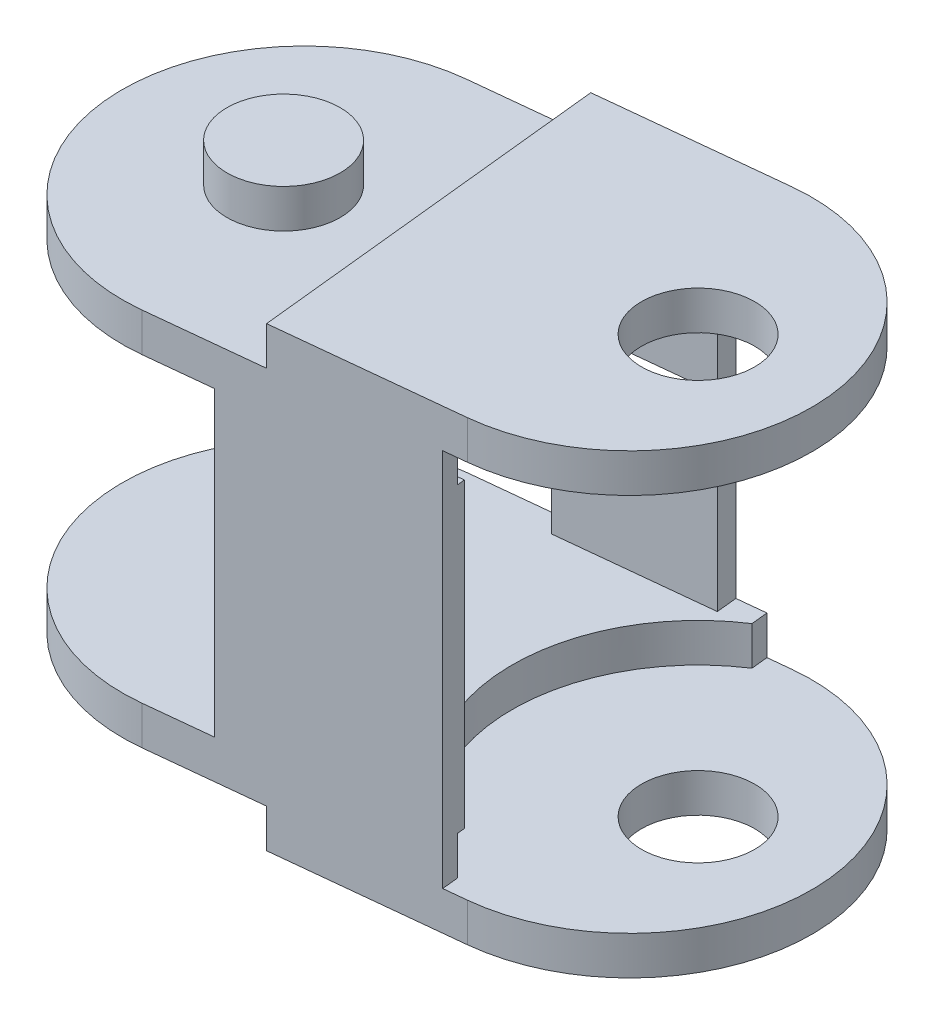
ISO-10303-21;
HEADER;
FILE_DESCRIPTION(('STEP AP214'),'2;1');
FILE_NAME('part.step','',(''),(''),'','','');
FILE_SCHEMA(('AUTOMOTIVE_DESIGN { 1 0 10303 214 1 1 1 1 }'));
ENDSEC;
DATA;
#1=APPLICATION_CONTEXT('core data for automotive mechanical design processes');
#2=APPLICATION_PROTOCOL_DEFINITION('international standard','automotive_design',2000,#1);
#3=PRODUCT_CONTEXT('',#1,'mechanical');
#4=PRODUCT('Part','Part','',(#3));
#5=PRODUCT_RELATED_PRODUCT_CATEGORY('part','',(#4));
#6=PRODUCT_DEFINITION_FORMATION('','',#4);
#7=PRODUCT_DEFINITION_CONTEXT('part definition',#1,'design');
#8=PRODUCT_DEFINITION('design','',#6,#7);
#9=PRODUCT_DEFINITION_SHAPE('','',#8);
#10=(LENGTH_UNIT() NAMED_UNIT(*) SI_UNIT(.MILLI.,.METRE.));
#11=(NAMED_UNIT(*) PLANE_ANGLE_UNIT() SI_UNIT($,.RADIAN.));
#12=(NAMED_UNIT(*) SI_UNIT($,.STERADIAN.) SOLID_ANGLE_UNIT());
#13=UNCERTAINTY_MEASURE_WITH_UNIT(LENGTH_MEASURE(1.E-05),#10,'distance_accuracy_value','');
#14=(GEOMETRIC_REPRESENTATION_CONTEXT(3) GLOBAL_UNCERTAINTY_ASSIGNED_CONTEXT((#13)) GLOBAL_UNIT_ASSIGNED_CONTEXT((#10,
#11,#12)) REPRESENTATION_CONTEXT('',''));
#15=CARTESIAN_POINT('',(0.,0.,0.));
#16=DIRECTION('',(0.,0.,1.));
#17=DIRECTION('',(1.,0.,0.));
#18=AXIS2_PLACEMENT_3D('',#15,#16,#17);
#19=CARTESIAN_POINT('',(-539.8914326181,20.1,2.0810834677));
#20=DIRECTION('',(0.,1.,0.));
#21=DIRECTION('',(0.,0.,1.));
#22=AXIS2_PLACEMENT_3D('',#19,#20,#21);
#23=PLANE('',#22);
#24=CARTESIAN_POINT('',(-539.8914326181,20.1,2.0810834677));
#25=DIRECTION('',(0.,-1.,0.));
#26=DIRECTION('',(0.,0.,-1.));
#27=AXIS2_PLACEMENT_3D('',#24,#25,#26);
#28=CIRCLE('',#27,3.00000000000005);
#29=CARTESIAN_POINT('',(-539.8914326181,20.1,-0.918916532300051));
#30=VERTEX_POINT('',#29);
#31=EDGE_CURVE('E381',#30,#30,#28,.T.);
#32=ORIENTED_EDGE('',*,*,#31,.F.);
#33=EDGE_LOOP('',(#32));
#34=FACE_BOUND('',#33,.T.);
#35=ADVANCED_FACE('F17',(#34),#23,.T.);
#36=CARTESIAN_POINT('',(-524.47557233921,8.,0.46824377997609));
#37=DIRECTION('',(0.99457163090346,0.,-0.104054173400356));
#38=DIRECTION('',(-0.104054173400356,0.,-0.99457163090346));
#39=AXIS2_PLACEMENT_3D('',#36,#37,#38);
#40=PLANE('',#39);
#41=DIRECTION('',(0.,1.,0.));
#42=VECTOR('',#41,1.);
#43=CARTESIAN_POINT('',(-525.47969511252,20.1,-9.1293724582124));
#44=LINE('',#43,#42);
#45=CARTESIAN_POINT('',(-525.479695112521,18.05,-9.12937245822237));
#46=VERTEX_POINT('',#45);
#47=CARTESIAN_POINT('',(-525.479695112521,16.,-9.1293724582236));
#48=VERTEX_POINT('',#47);
#49=EDGE_CURVE('E390',#46,#48,#44,.F.);
#50=ORIENTED_EDGE('',*,*,#49,.F.);
#51=DIRECTION('',(-0.104054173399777,0.,-0.994571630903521));
#52=VECTOR('',#51,1.);
#53=CARTESIAN_POINT('',(-525.38729415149,18.05,-8.24618467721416));
#54=LINE('',#53,#52);
#55=CARTESIAN_POINT('',(-525.38729415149,18.05,-8.24618467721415));
#56=VERTEX_POINT('',#55);
#57=EDGE_CURVE('E393',#56,#46,#54,.T.);
#58=ORIENTED_EDGE('',*,*,#57,.F.);
#59=DIRECTION('',(0.,-1.,0.));
#60=VECTOR('',#59,1.);
#61=CARTESIAN_POINT('',(-525.38729415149,17.025,-8.24618467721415));
#62=LINE('',#61,#60);
#63=CARTESIAN_POINT('',(-525.38729415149,16.,-8.2461846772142));
#64=VERTEX_POINT('',#63);
#65=EDGE_CURVE('E378',#56,#64,#62,.T.);
#66=ORIENTED_EDGE('',*,*,#65,.T.);
#67=DIRECTION('',(-0.104054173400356,0.,-0.99457163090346));
#68=VECTOR('',#67,1.);
#69=CARTESIAN_POINT('',(-524.47557233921,16.,0.46824377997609));
#70=LINE('',#69,#68);
#71=EDGE_CURVE('E236',#64,#48,#70,.T.);
#72=ORIENTED_EDGE('',*,*,#71,.T.);
#73=EDGE_LOOP('',(#50,#58,#66,#72));
#74=FACE_BOUND('',#73,.T.);
#75=ADVANCED_FACE('F798',(#74),#40,.T.);
#76=CARTESIAN_POINT('',(-534.870895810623,8.,-7.59384341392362));
#77=DIRECTION('',(0.99457163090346,0.,-0.104054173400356));
#78=DIRECTION('',(-0.104054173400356,0.,-0.99457163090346));
#79=AXIS2_PLACEMENT_3D('',#76,#77,#78);
#80=PLANE('',#79);
#81=DIRECTION('',(0.,1.,0.));
#82=VECTOR('',#81,1.);
#83=CARTESIAN_POINT('',(-534.813666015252,8.,-7.0468290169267));
#84=LINE('',#83,#82);
#85=CARTESIAN_POINT('',(-534.813666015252,10.,-7.04682901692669));
#86=VERTEX_POINT('',#85);
#87=CARTESIAN_POINT('',(-534.813666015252,16.,-7.04682901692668));
#88=VERTEX_POINT('',#87);
#89=EDGE_CURVE('E230',#86,#88,#84,.T.);
#90=ORIENTED_EDGE('',*,*,#89,.T.);
#91=DIRECTION('',(-0.104054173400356,0.,-0.99457163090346));
#92=VECTOR('',#91,1.);
#93=CARTESIAN_POINT('',(-534.870895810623,16.,-7.59384341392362));
#94=LINE('',#93,#92);
#95=CARTESIAN_POINT('',(-534.928125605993,16.,-8.14085781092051));
#96=VERTEX_POINT('',#95);
#97=EDGE_CURVE('E225',#96,#88,#94,.F.);
#98=ORIENTED_EDGE('',*,*,#97,.F.);
#99=DIRECTION('',(0.,1.,0.));
#100=VECTOR('',#99,1.);
#101=CARTESIAN_POINT('',(-534.928125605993,20.1,-8.14085781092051));
#102=LINE('',#101,#100);
#103=CARTESIAN_POINT('',(-534.928125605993,10.,-8.14085781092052));
#104=VERTEX_POINT('',#103);
#105=EDGE_CURVE('E229',#104,#96,#102,.T.);
#106=ORIENTED_EDGE('',*,*,#105,.F.);
#107=DIRECTION('',(-0.104054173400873,0.,-0.994571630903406));
#108=VECTOR('',#107,1.);
#109=CARTESIAN_POINT('',(-534.813666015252,10.,-7.04682901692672));
#110=LINE('',#109,#108);
#111=EDGE_CURVE('E407',#86,#104,#110,.T.);
#112=ORIENTED_EDGE('',*,*,#111,.F.);
#113=EDGE_LOOP('',(#90,#98,#106,#112));
#114=FACE_BOUND('',#113,.T.);
#115=ADVANCED_FACE('F227',(#114),#80,.F.);
#116=CARTESIAN_POINT('',(-526.914322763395,8.,-8.42627680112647));
#117=DIRECTION('',(-0.99457163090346,0.,0.104054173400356));
#118=DIRECTION('',(0.104054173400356,0.,0.99457163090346));
#119=AXIS2_PLACEMENT_3D('',#116,#117,#118);
#120=PLANE('',#119);
#121=DIRECTION('',(0.,1.,0.));
#122=VECTOR('',#121,1.);
#123=CARTESIAN_POINT('',(-526.971552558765,20.1,-8.97329119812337));
#124=LINE('',#123,#122);
#125=CARTESIAN_POINT('',(-526.971552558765,16.,-8.97329119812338));
#126=VERTEX_POINT('',#125);
#127=CARTESIAN_POINT('',(-526.971552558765,10.,-8.97329119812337));
#128=VERTEX_POINT('',#127);
#129=EDGE_CURVE('E424',#126,#128,#124,.F.);
#130=ORIENTED_EDGE('',*,*,#129,.F.);
#131=DIRECTION('',(0.104054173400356,0.,0.99457163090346));
#132=VECTOR('',#131,1.);
#133=CARTESIAN_POINT('',(-526.914322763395,16.,-8.42627680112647));
#134=LINE('',#133,#132);
#135=CARTESIAN_POINT('',(-526.857092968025,16.,-7.87926240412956));
#136=VERTEX_POINT('',#135);
#137=EDGE_CURVE('E235',#136,#126,#134,.F.);
#138=ORIENTED_EDGE('',*,*,#137,.F.);
#139=DIRECTION('',(0.,1.,0.));
#140=VECTOR('',#139,1.);
#141=CARTESIAN_POINT('',(-526.857092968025,8.,-7.87926240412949));
#142=LINE('',#141,#140);
#143=CARTESIAN_POINT('',(-526.857092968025,10.,-7.87926240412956));
#144=VERTEX_POINT('',#143);
#145=EDGE_CURVE('E436',#136,#144,#142,.F.);
#146=ORIENTED_EDGE('',*,*,#145,.T.);
#147=DIRECTION('',(0.104054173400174,0.,0.994571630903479));
#148=VECTOR('',#147,1.);
#149=CARTESIAN_POINT('',(-526.971552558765,10.,-8.97329119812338));
#150=LINE('',#149,#148);
#151=EDGE_CURVE('E402',#128,#144,#150,.T.);
#152=ORIENTED_EDGE('',*,*,#151,.F.);
#153=EDGE_LOOP('',(#130,#138,#146,#152));
#154=FACE_BOUND('',#153,.T.);
#155=ADVANCED_FACE('F792',(#154),#120,.F.);
#156=CARTESIAN_POINT('',(-530.892609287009,10.,-8.01006010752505));
#157=DIRECTION('',(0.,-1.,0.));
#158=DIRECTION('',(0.,0.,-1.));
#159=AXIS2_PLACEMENT_3D('',#156,#157,#158);
#160=PLANE('',#159);
#161=ORIENTED_EDGE('',*,*,#151,.T.);
#162=DIRECTION('',(-0.99457163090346,0.,0.104054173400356));
#163=VECTOR('',#162,1.);
#164=CARTESIAN_POINT('',(-530.835379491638,10.,-7.46304571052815));
#165=LINE('',#164,#163);
#166=EDGE_CURVE('E432',#144,#86,#165,.T.);
#167=ORIENTED_EDGE('',*,*,#166,.T.);
#168=ORIENTED_EDGE('',*,*,#111,.T.);
#169=DIRECTION('',(-0.99457163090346,0.,0.104054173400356));
#170=VECTOR('',#169,1.);
#171=CARTESIAN_POINT('',(-532.093596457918,10.,-8.43741220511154));
#172=LINE('',#171,#170);
#173=EDGE_CURVE('E246',#128,#104,#172,.T.);
#174=ORIENTED_EDGE('',*,*,#173,.F.);
#175=EDGE_LOOP('',(#161,#167,#168,#174));
#176=FACE_BOUND('',#175,.T.);
#177=ADVANCED_FACE('F788',(#176),#160,.T.);
#178=CARTESIAN_POINT('',(-539.8914326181,-4.1,2.0810834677));
#179=DIRECTION('',(0.,-1.,0.));
#180=DIRECTION('',(0.,0.,-1.));
#181=AXIS2_PLACEMENT_3D('',#178,#179,#180);
#182=PLANE('',#181);
#183=CARTESIAN_POINT('',(-539.8914326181,-4.1,2.0810834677));
#184=DIRECTION('',(0.,-1.,0.));
#185=DIRECTION('',(0.,0.,-1.));
#186=AXIS2_PLACEMENT_3D('',#183,#184,#185);
#187=CIRCLE('',#186,3.00000000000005);
#188=CARTESIAN_POINT('',(-539.8914326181,-4.1,-0.918916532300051));
#189=VERTEX_POINT('',#188);
#190=EDGE_CURVE('E435',#189,#189,#187,.F.);
#191=ORIENTED_EDGE('',*,*,#190,.F.);
#192=EDGE_LOOP('',(#191));
#193=FACE_BOUND('',#192,.T.);
#194=ADVANCED_FACE('F785',(#193),#182,.T.);
#195=CARTESIAN_POINT('',(-514.529856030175,18.05,-0.572297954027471));
#196=DIRECTION('',(0.,-1.,0.));
#197=DIRECTION('',(0.,0.,-1.));
#198=AXIS2_PLACEMENT_3D('',#195,#196,#197);
#199=PLANE('',#198);
#200=CARTESIAN_POINT('',(-520.000000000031,18.05,-3.07121883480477E-10));
#201=DIRECTION('',(0.,-1.,0.));
#202=DIRECTION('',(0.,0.,-1.));
#203=AXIS2_PLACEMENT_3D('',#200,#201,#202);
#204=CIRCLE('',#203,3.00000000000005);
#205=CARTESIAN_POINT('',(-520.000000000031,18.05,-3.00000000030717));
#206=VERTEX_POINT('',#205);
#207=EDGE_CURVE('E20',#206,#206,#204,.F.);
#208=ORIENTED_EDGE('',*,*,#207,.T.);
#209=EDGE_LOOP('',(#208));
#210=FACE_BOUND('',#209,.T.);
#211=ORIENTED_EDGE('',*,*,#57,.T.);
#212=DIRECTION('',(-0.99457163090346,0.,0.104054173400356));
#213=VECTOR('',#212,1.);
#214=CARTESIAN_POINT('',(-532.093596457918,18.05,-8.43741220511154));
#215=LINE('',#214,#213);
#216=CARTESIAN_POINT('',(-524.286209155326,18.05,-9.25423746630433));
#217=VERTEX_POINT('',#216);
#218=EDGE_CURVE('E247',#217,#46,#215,.T.);
#219=ORIENTED_EDGE('',*,*,#218,.F.);
#220=CARTESIAN_POINT('',(-523.282086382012,18.05,0.343378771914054));
#221=DIRECTION('',(0.,-1.,0.));
#222=DIRECTION('',(0.,0.,-1.));
#223=AXIS2_PLACEMENT_3D('',#220,#221,#222);
#224=CIRCLE('',#223,9.65);
#225=CARTESIAN_POINT('',(-522.277963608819,18.05,9.94099501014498));
#226=VERTEX_POINT('',#225);
#227=EDGE_CURVE('E387',#226,#217,#224,.F.);
#228=ORIENTED_EDGE('',*,*,#227,.F.);
#229=DIRECTION('',(-0.994571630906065,0.,0.104054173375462));
#230=VECTOR('',#229,1.);
#231=CARTESIAN_POINT('',(-522.277963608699,18.05,9.94099501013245));
#232=LINE('',#231,#230);
#233=CARTESIAN_POINT('',(-523.471449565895,18.05,10.0658600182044));
#234=VERTEX_POINT('',#233);
#235=EDGE_CURVE('E398',#226,#234,#232,.T.);
#236=ORIENTED_EDGE('',*,*,#235,.T.);
#237=DIRECTION('',(-0.104054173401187,0.,-0.994571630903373));
#238=VECTOR('',#237,1.);
#239=CARTESIAN_POINT('',(-523.471449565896,18.05,10.0658600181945));
#240=LINE('',#239,#238);
#241=CARTESIAN_POINT('',(-523.563850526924,18.05,9.18267223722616));
#242=VERTEX_POINT('',#241);
#243=EDGE_CURVE('E139',#234,#242,#240,.T.);
#244=ORIENTED_EDGE('',*,*,#243,.T.);
#245=CARTESIAN_POINT('',(-520.000000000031,18.05,-3.07121883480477E-10));
#246=DIRECTION('',(0.,-1.,0.));
#247=DIRECTION('',(0.,0.,-1.));
#248=AXIS2_PLACEMENT_3D('',#245,#246,#247);
#249=CIRCLE('',#248,9.85000000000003);
#250=EDGE_CURVE('E498',#242,#56,#249,.T.);
#251=ORIENTED_EDGE('',*,*,#250,.T.);
#252=EDGE_LOOP('',(#211,#219,#228,#236,#244,#251));
#253=FACE_BOUND('',#252,.T.);
#254=ADVANCED_FACE('F507',(#210,#253),#199,.T.);
#255=CARTESIAN_POINT('',(-520.000000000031,19.075,-3.07121883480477E-10));
#256=DIRECTION('',(0.,-1.,0.));
#257=DIRECTION('',(0.,0.,-1.));
#258=AXIS2_PLACEMENT_3D('',#255,#256,#257);
#259=CYLINDRICAL_SURFACE('',#258,3.00000000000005);
#260=ORIENTED_EDGE('',*,*,#207,.F.);
#261=EDGE_LOOP('',(#260));
#262=FACE_BOUND('',#261,.T.);
#263=CARTESIAN_POINT('',(-520.000000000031,20.1,-3.07121883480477E-10));
#264=DIRECTION('',(0.,-1.,0.));
#265=DIRECTION('',(0.,0.,-1.));
#266=AXIS2_PLACEMENT_3D('',#263,#264,#265);
#267=CIRCLE('',#266,3.00000000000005);
#268=CARTESIAN_POINT('',(-520.000000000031,20.1,-3.00000000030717));
#269=VERTEX_POINT('',#268);
#270=EDGE_CURVE('E383',#269,#269,#267,.F.);
#271=ORIENTED_EDGE('',*,*,#270,.T.);
#272=EDGE_LOOP('',(#271));
#273=FACE_BOUND('',#272,.T.);
#274=ADVANCED_FACE('F509',(#262,#273),#259,.F.);
#275=CARTESIAN_POINT('',(-539.8914326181,19.075,2.0810834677));
#276=DIRECTION('',(0.,-1.,0.));
#277=DIRECTION('',(0.,0.,-1.));
#278=AXIS2_PLACEMENT_3D('',#275,#276,#277);
#279=CYLINDRICAL_SURFACE('',#278,3.00000000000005);
#280=ORIENTED_EDGE('',*,*,#31,.T.);
#281=EDGE_LOOP('',(#280));
#282=FACE_BOUND('',#281,.T.);
#283=CARTESIAN_POINT('',(-539.8914326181,18.05,2.0810834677));
#284=DIRECTION('',(0.,-1.,0.));
#285=DIRECTION('',(0.,0.,-1.));
#286=AXIS2_PLACEMENT_3D('',#283,#284,#285);
#287=CIRCLE('',#286,3.00000000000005);
#288=CARTESIAN_POINT('',(-539.8914326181,18.05,-0.918916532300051));
#289=VERTEX_POINT('',#288);
#290=EDGE_CURVE('E284',#289,#289,#287,.F.);
#291=ORIENTED_EDGE('',*,*,#290,.T.);
#292=EDGE_LOOP('',(#291));
#293=FACE_BOUND('',#292,.T.);
#294=ADVANCED_FACE('F512',(#282,#293),#279,.T.);
#295=CARTESIAN_POINT('',(-532.093596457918,20.1,-8.43741220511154));
#296=DIRECTION('',(-0.104054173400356,0.,-0.99457163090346));
#297=DIRECTION('',(-0.99457163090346,0.,0.104054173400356));
#298=AXIS2_PLACEMENT_3D('',#295,#296,#297);
#299=PLANE('',#298);
#300=DIRECTION('',(-0.99457163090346,0.,0.104054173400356));
#301=VECTOR('',#300,1.);
#302=CARTESIAN_POINT('',(-532.093596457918,16.,-8.43741220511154));
#303=LINE('',#302,#301);
#304=EDGE_CURVE('E410',#48,#126,#303,.T.);
#305=ORIENTED_EDGE('',*,*,#304,.T.);
#306=ORIENTED_EDGE('',*,*,#129,.T.);
#307=ORIENTED_EDGE('',*,*,#173,.T.);
#308=ORIENTED_EDGE('',*,*,#105,.T.);
#309=DIRECTION('',(0.994571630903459,0.,-0.104054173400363));
#310=VECTOR('',#309,1.);
#311=CARTESIAN_POINT('',(-539.90098376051,16.,-7.62058694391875));
#312=LINE('',#311,#310);
#313=CARTESIAN_POINT('',(-539.90098376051,16.,-7.62058694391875));
#314=VERTEX_POINT('',#313);
#315=EDGE_CURVE('E243',#314,#96,#312,.T.);
#316=ORIENTED_EDGE('',*,*,#315,.F.);
#317=DIRECTION('',(0.,-1.,0.));
#318=VECTOR('',#317,1.);
#319=CARTESIAN_POINT('',(-539.90098376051,20.1,-7.62058694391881));
#320=LINE('',#319,#318);
#321=CARTESIAN_POINT('',(-539.900983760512,18.05,-7.6205869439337));
#322=VERTEX_POINT('',#321);
#323=EDGE_CURVE('E375',#322,#314,#320,.T.);
#324=ORIENTED_EDGE('',*,*,#323,.F.);
#325=DIRECTION('',(0.994571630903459,0.,-0.104054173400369));
#326=VECTOR('',#325,1.);
#327=CARTESIAN_POINT('',(-539.900983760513,18.05,-7.62058694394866));
#328=LINE('',#327,#326);
#329=CARTESIAN_POINT('',(-533.933553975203,18.05,-8.2449119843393));
#330=VERTEX_POINT('',#329);
#331=EDGE_CURVE('E275',#322,#330,#328,.T.);
#332=ORIENTED_EDGE('',*,*,#331,.T.);
#333=DIRECTION('',(0.,1.,0.));
#334=VECTOR('',#333,1.);
#335=CARTESIAN_POINT('',(-533.933553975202,19.075,-8.24491198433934));
#336=LINE('',#335,#334);
#337=CARTESIAN_POINT('',(-533.933553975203,20.1,-8.24491198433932));
#338=VERTEX_POINT('',#337);
#339=EDGE_CURVE('E293',#338,#330,#336,.F.);
#340=ORIENTED_EDGE('',*,*,#339,.F.);
#341=DIRECTION('',(0.994571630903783,0.,-0.104054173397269));
#342=VECTOR('',#341,1.);
#343=CARTESIAN_POINT('',(-533.933553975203,20.1,-8.24491198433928));
#344=LINE('',#343,#342);
#345=CARTESIAN_POINT('',(-524.286209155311,20.1,-9.2542374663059));
#346=VERTEX_POINT('',#345);
#347=EDGE_CURVE('E300',#338,#346,#344,.T.);
#348=ORIENTED_EDGE('',*,*,#347,.T.);
#349=DIRECTION('',(0.,-1.,0.));
#350=VECTOR('',#349,1.);
#351=CARTESIAN_POINT('',(-524.286209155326,20.1,-9.25423746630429));
#352=LINE('',#351,#350);
#353=EDGE_CURVE('E304',#217,#346,#352,.F.);
#354=ORIENTED_EDGE('',*,*,#353,.F.);
#355=ORIENTED_EDGE('',*,*,#218,.T.);
#356=ORIENTED_EDGE('',*,*,#49,.T.);
#357=EDGE_LOOP('',(#305,#306,#307,#308,#316,#324,#332,#340,#348,#354,#355,#356));
#358=FACE_BOUND('',#357,.T.);
#359=ADVANCED_FACE('F241',(#358),#299,.T.);
#360=CARTESIAN_POINT('',(-530.835379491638,8.,-7.46304571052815));
#361=DIRECTION('',(-0.104054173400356,0.,-0.99457163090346));
#362=DIRECTION('',(-0.99457163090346,0.,0.104054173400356));
#363=AXIS2_PLACEMENT_3D('',#360,#361,#362);
#364=PLANE('',#363);
#365=ORIENTED_EDGE('',*,*,#145,.F.);
#366=DIRECTION('',(0.994571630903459,0.,-0.104054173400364));
#367=VECTOR('',#366,1.);
#368=CARTESIAN_POINT('',(-534.813666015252,16.,-7.04682901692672));
#369=LINE('',#368,#367);
#370=EDGE_CURVE('E255',#88,#136,#369,.T.);
#371=ORIENTED_EDGE('',*,*,#370,.F.);
#372=ORIENTED_EDGE('',*,*,#89,.F.);
#373=ORIENTED_EDGE('',*,*,#166,.F.);
#374=EDGE_LOOP('',(#365,#371,#372,#373));
#375=FACE_BOUND('',#374,.T.);
#376=ADVANCED_FACE('F770',(#375),#364,.F.);
#377=CARTESIAN_POINT('',(-539.8914326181,-3.075,2.0810834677));
#378=DIRECTION('',(0.,-1.,0.));
#379=DIRECTION('',(0.,0.,-1.));
#380=AXIS2_PLACEMENT_3D('',#377,#378,#379);
#381=CYLINDRICAL_SURFACE('',#380,3.00000000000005);
#382=CARTESIAN_POINT('',(-539.8914326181,-2.05,2.0810834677));
#383=DIRECTION('',(0.,-1.,0.));
#384=DIRECTION('',(0.,0.,-1.));
#385=AXIS2_PLACEMENT_3D('',#382,#383,#384);
#386=CIRCLE('',#385,3.00000000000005);
#387=CARTESIAN_POINT('',(-539.8914326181,-2.05,-0.918916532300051));
#388=VERTEX_POINT('',#387);
#389=EDGE_CURVE('E473',#388,#388,#386,.F.);
#390=ORIENTED_EDGE('',*,*,#389,.F.);
#391=EDGE_LOOP('',(#390));
#392=FACE_BOUND('',#391,.T.);
#393=ORIENTED_EDGE('',*,*,#190,.T.);
#394=EDGE_LOOP('',(#393));
#395=FACE_BOUND('',#394,.T.);
#396=ADVANCED_FACE('F760',(#392,#395),#381,.T.);
#397=CARTESIAN_POINT('',(-520.000000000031,-3.075,-3.07121883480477E-10));
#398=DIRECTION('',(0.,-1.,0.));
#399=DIRECTION('',(0.,0.,-1.));
#400=AXIS2_PLACEMENT_3D('',#397,#398,#399);
#401=CYLINDRICAL_SURFACE('',#400,3.00000000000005);
#402=CARTESIAN_POINT('',(-520.000000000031,-4.1,-3.07121883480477E-10));
#403=DIRECTION('',(0.,-1.,0.));
#404=DIRECTION('',(0.,0.,-1.));
#405=AXIS2_PLACEMENT_3D('',#402,#403,#404);
#406=CIRCLE('',#405,3.00000000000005);
#407=CARTESIAN_POINT('',(-520.000000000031,-4.1,-3.00000000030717));
#408=VERTEX_POINT('',#407);
#409=EDGE_CURVE('E478',#408,#408,#406,.F.);
#410=ORIENTED_EDGE('',*,*,#409,.F.);
#411=EDGE_LOOP('',(#410));
#412=FACE_BOUND('',#411,.T.);
#413=CARTESIAN_POINT('',(-520.000000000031,-2.05,-3.07121883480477E-10));
#414=DIRECTION('',(0.,-1.,0.));
#415=DIRECTION('',(0.,0.,-1.));
#416=AXIS2_PLACEMENT_3D('',#413,#414,#415);
#417=CIRCLE('',#416,3.00000000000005);
#418=CARTESIAN_POINT('',(-520.000000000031,-2.05,-3.00000000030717));
#419=VERTEX_POINT('',#418);
#420=EDGE_CURVE('E345',#419,#419,#417,.F.);
#421=ORIENTED_EDGE('',*,*,#420,.T.);
#422=EDGE_LOOP('',(#421));
#423=FACE_BOUND('',#422,.T.);
#424=ADVANCED_FACE('F757',(#412,#423),#401,.F.);
#425=CARTESIAN_POINT('',(-520.000000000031,17.025,-3.07121883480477E-10));
#426=DIRECTION('',(0.,-1.,0.));
#427=DIRECTION('',(0.,0.,-1.));
#428=AXIS2_PLACEMENT_3D('',#425,#426,#427);
#429=CYLINDRICAL_SURFACE('',#428,9.85000000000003);
#430=ORIENTED_EDGE('',*,*,#250,.F.);
#431=DIRECTION('',(0.,1.,0.));
#432=VECTOR('',#431,1.);
#433=CARTESIAN_POINT('',(-523.563850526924,8.,9.18267223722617));
#434=LINE('',#433,#432);
#435=CARTESIAN_POINT('',(-523.563850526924,16.,9.18267223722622));
#436=VERTEX_POINT('',#435);
#437=EDGE_CURVE('E344',#436,#242,#434,.T.);
#438=ORIENTED_EDGE('',*,*,#437,.F.);
#439=CARTESIAN_POINT('',(-520.000000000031,16.,-3.07121883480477E-10));
#440=DIRECTION('',(0.,-1.,0.));
#441=DIRECTION('',(0.,0.,-1.));
#442=AXIS2_PLACEMENT_3D('',#439,#440,#441);
#443=CIRCLE('',#442,9.85000000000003);
#444=CARTESIAN_POINT('',(-524.3117762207,16.,8.85613266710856));
#445=VERTEX_POINT('',#444);
#446=EDGE_CURVE('E495',#436,#445,#443,.T.);
#447=ORIENTED_EDGE('',*,*,#446,.T.);
#448=CARTESIAN_POINT('',(-520.000000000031,16.,-3.07121883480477E-10));
#449=DIRECTION('',(0.,-1.,0.));
#450=DIRECTION('',(0.,0.,-1.));
#451=AXIS2_PLACEMENT_3D('',#448,#449,#450);
#452=CIRCLE('',#451,9.85000000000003);
#453=EDGE_CURVE('E259',#64,#445,#452,.F.);
#454=ORIENTED_EDGE('',*,*,#453,.F.);
#455=ORIENTED_EDGE('',*,*,#65,.F.);
#456=EDGE_LOOP('',(#430,#438,#447,#454,#455));
#457=FACE_BOUND('',#456,.T.);
#458=ADVANCED_FACE('F759',(#457),#429,.F.);
#459=CARTESIAN_POINT('',(-520.000000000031,16.,-3.07121883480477E-10));
#460=DIRECTION('',(0.,-1.,0.));
#461=DIRECTION('',(0.,0.,-1.));
#462=AXIS2_PLACEMENT_3D('',#459,#460,#461);
#463=PLANE('',#462);
#464=ORIENTED_EDGE('',*,*,#446,.F.);
#465=DIRECTION('',(-0.104054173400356,0.,-0.99457163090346));
#466=VECTOR('',#465,1.);
#467=CARTESIAN_POINT('',(-524.47557233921,16.,0.46824377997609));
#468=LINE('',#467,#466);
#469=CARTESIAN_POINT('',(-523.60574188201,16.,8.78226587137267));
#470=VERTEX_POINT('',#469);
#471=EDGE_CURVE('E341',#470,#436,#468,.F.);
#472=ORIENTED_EDGE('',*,*,#471,.F.);
#473=DIRECTION('',(0.99457163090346,0.,-0.104054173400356));
#474=VECTOR('',#473,1.);
#475=CARTESIAN_POINT('',(-529.075885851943,16.,9.35456382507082));
#476=LINE('',#475,#474);
#477=EDGE_CURVE('E329',#470,#445,#476,.F.);
#478=ORIENTED_EDGE('',*,*,#477,.T.);
#479=EDGE_LOOP('',(#464,#472,#478));
#480=FACE_BOUND('',#479,.T.);
#481=ADVANCED_FACE('F767',(#480),#463,.F.);
#482=CARTESIAN_POINT('',(-523.282086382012,20.1,0.343378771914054));
#483=DIRECTION('',(0.,-1.,0.));
#484=DIRECTION('',(0.,0.,-1.));
#485=AXIS2_PLACEMENT_3D('',#482,#483,#484);
#486=CYLINDRICAL_SURFACE('',#485,9.65);
#487=CARTESIAN_POINT('',(-523.282086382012,20.1,0.343378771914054));
#488=DIRECTION('',(0.,-1.,0.));
#489=DIRECTION('',(0.,0.,-1.));
#490=AXIS2_PLACEMENT_3D('',#487,#488,#489);
#491=CIRCLE('',#490,9.65);
#492=CARTESIAN_POINT('',(-522.277963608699,20.1,9.94099501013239));
#493=VERTEX_POINT('',#492);
#494=EDGE_CURVE('E303',#346,#493,#491,.T.);
#495=ORIENTED_EDGE('',*,*,#494,.T.);
#496=DIRECTION('',(0.,1.,0.));
#497=VECTOR('',#496,1.);
#498=CARTESIAN_POINT('',(-522.277963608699,20.1,9.94099501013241));
#499=LINE('',#498,#497);
#500=EDGE_CURVE('E297',#226,#493,#499,.T.);
#501=ORIENTED_EDGE('',*,*,#500,.F.);
#502=ORIENTED_EDGE('',*,*,#227,.T.);
#503=ORIENTED_EDGE('',*,*,#353,.T.);
#504=EDGE_LOOP('',(#495,#501,#502,#503));
#505=FACE_BOUND('',#504,.T.);
#506=ADVANCED_FACE('F520',(#505),#486,.T.);
#507=CARTESIAN_POINT('',(-531.089473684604,20.1,1.16020403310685));
#508=DIRECTION('',(0.,-1.,0.));
#509=DIRECTION('',(0.,0.,-1.));
#510=AXIS2_PLACEMENT_3D('',#507,#508,#509);
#511=PLANE('',#510);
#512=ORIENTED_EDGE('',*,*,#270,.F.);
#513=EDGE_LOOP('',(#512));
#514=FACE_BOUND('',#513,.T.);
#515=DIRECTION('',(0.99457163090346,0.,-0.104054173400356));
#516=VECTOR('',#515,1.);
#517=CARTESIAN_POINT('',(-530.085350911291,20.1,10.7578202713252));
#518=LINE('',#517,#516);
#519=CARTESIAN_POINT('',(-531.925308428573,20.1,10.9503204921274));
#520=VERTEX_POINT('',#519);
#521=EDGE_CURVE('E288',#493,#520,#518,.F.);
#522=ORIENTED_EDGE('',*,*,#521,.F.);
#523=ORIENTED_EDGE('',*,*,#494,.F.);
#524=ORIENTED_EDGE('',*,*,#347,.F.);
#525=DIRECTION('',(0.104054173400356,0.,0.99457163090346));
#526=VECTOR('',#525,1.);
#527=CARTESIAN_POINT('',(-532.929431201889,20.1,1.35270425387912));
#528=LINE('',#527,#526);
#529=EDGE_CURVE('E279',#520,#338,#528,.F.);
#530=ORIENTED_EDGE('',*,*,#529,.F.);
#531=EDGE_LOOP('',(#522,#523,#524,#530));
#532=FACE_BOUND('',#531,.T.);
#533=ADVANCED_FACE('F516',(#514,#532),#511,.F.);
#534=CARTESIAN_POINT('',(-532.929431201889,19.075,1.35270425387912));
#535=DIRECTION('',(-0.99457163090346,0.,0.104054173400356));
#536=DIRECTION('',(0.104054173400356,0.,0.99457163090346));
#537=AXIS2_PLACEMENT_3D('',#534,#535,#536);
#538=PLANE('',#537);
#539=DIRECTION('',(0.,1.,0.));
#540=VECTOR('',#539,1.);
#541=CARTESIAN_POINT('',(-531.925308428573,20.1,10.9503204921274));
#542=LINE('',#541,#540);
#543=CARTESIAN_POINT('',(-531.925308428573,18.05,10.9503204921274));
#544=VERTEX_POINT('',#543);
#545=EDGE_CURVE('E272',#520,#544,#542,.F.);
#546=ORIENTED_EDGE('',*,*,#545,.F.);
#547=ORIENTED_EDGE('',*,*,#529,.T.);
#548=ORIENTED_EDGE('',*,*,#339,.T.);
#549=DIRECTION('',(0.104054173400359,0.,0.99457163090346));
#550=VECTOR('',#549,1.);
#551=CARTESIAN_POINT('',(-533.933553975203,18.05,-8.24491198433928));
#552=LINE('',#551,#550);
#553=EDGE_CURVE('E278',#330,#544,#552,.T.);
#554=ORIENTED_EDGE('',*,*,#553,.T.);
#555=EDGE_LOOP('',(#546,#547,#548,#554));
#556=FACE_BOUND('',#555,.T.);
#557=ADVANCED_FACE('F519',(#556),#538,.T.);
#558=CARTESIAN_POINT('',(-541.20924002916,18.05,2.21895524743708));
#559=DIRECTION('',(0.,-1.,0.));
#560=DIRECTION('',(0.,0.,-1.));
#561=AXIS2_PLACEMENT_3D('',#558,#559,#560);
#562=PLANE('',#561);
#563=ORIENTED_EDGE('',*,*,#290,.F.);
#564=EDGE_LOOP('',(#563));
#565=FACE_BOUND('',#564,.T.);
#566=DIRECTION('',(0.99457163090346,0.,-0.104054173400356));
#567=VECTOR('',#566,1.);
#568=CARTESIAN_POINT('',(-530.085350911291,18.05,10.7578202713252));
#569=LINE('',#568,#567);
#570=CARTESIAN_POINT('',(-537.892738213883,18.05,11.574645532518));
#571=VERTEX_POINT('',#570);
#572=EDGE_CURVE('E270',#544,#571,#569,.F.);
#573=ORIENTED_EDGE('',*,*,#572,.F.);
#574=ORIENTED_EDGE('',*,*,#553,.F.);
#575=ORIENTED_EDGE('',*,*,#331,.F.);
#576=CARTESIAN_POINT('',(-538.896860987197,18.05,1.97702929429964));
#577=DIRECTION('',(0.,-1.,0.));
#578=DIRECTION('',(0.,0.,-1.));
#579=AXIS2_PLACEMENT_3D('',#576,#577,#578);
#580=CIRCLE('',#579,9.65);
#581=EDGE_CURVE('E377',#571,#322,#580,.T.);
#582=ORIENTED_EDGE('',*,*,#581,.F.);
#583=EDGE_LOOP('',(#573,#574,#575,#582));
#584=FACE_BOUND('',#583,.T.);
#585=ADVANCED_FACE('F541',(#565,#584),#562,.F.);
#586=CARTESIAN_POINT('',(-538.896860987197,20.1,1.97702929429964));
#587=DIRECTION('',(0.,-1.,0.));
#588=DIRECTION('',(0.,0.,-1.));
#589=AXIS2_PLACEMENT_3D('',#586,#587,#588);
#590=CYLINDRICAL_SURFACE('',#589,9.65);
#591=CARTESIAN_POINT('',(-538.896860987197,16.,1.97702929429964));
#592=DIRECTION('',(0.,-1.,0.));
#593=DIRECTION('',(0.,0.,-1.));
#594=AXIS2_PLACEMENT_3D('',#591,#592,#593);
#595=CIRCLE('',#594,9.65);
#596=CARTESIAN_POINT('',(-537.892738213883,16.,11.574645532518));
#597=VERTEX_POINT('',#596);
#598=EDGE_CURVE('E254',#597,#314,#595,.T.);
#599=ORIENTED_EDGE('',*,*,#598,.F.);
#600=DIRECTION('',(0.,1.,0.));
#601=VECTOR('',#600,1.);
#602=CARTESIAN_POINT('',(-537.892738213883,20.1,11.574645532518));
#603=LINE('',#602,#601);
#604=EDGE_CURVE('E267',#571,#597,#603,.F.);
#605=ORIENTED_EDGE('',*,*,#604,.F.);
#606=ORIENTED_EDGE('',*,*,#581,.T.);
#607=ORIENTED_EDGE('',*,*,#323,.T.);
#608=EDGE_LOOP('',(#599,#605,#606,#607));
#609=FACE_BOUND('',#608,.T.);
#610=ADVANCED_FACE('F546',(#609),#590,.T.);
#611=CARTESIAN_POINT('',(-529.945716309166,16.,1.04054173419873));
#612=DIRECTION('',(0.,-1.,0.));
#613=DIRECTION('',(0.,0.,-1.));
#614=AXIS2_PLACEMENT_3D('',#611,#612,#613);
#615=PLANE('',#614);
#616=ORIENTED_EDGE('',*,*,#304,.F.);
#617=ORIENTED_EDGE('',*,*,#71,.F.);
#618=ORIENTED_EDGE('',*,*,#453,.T.);
#619=DIRECTION('',(0.99457163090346,0.,-0.104054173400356));
#620=VECTOR('',#619,1.);
#621=CARTESIAN_POINT('',(-529.075885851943,16.,9.35456382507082));
#622=LINE('',#621,#620);
#623=CARTESIAN_POINT('',(-534.546029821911,16.,9.92686177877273));
#624=VERTEX_POINT('',#623);
#625=EDGE_CURVE('E325',#445,#624,#622,.F.);
#626=ORIENTED_EDGE('',*,*,#625,.T.);
#627=DIRECTION('',(-0.104054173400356,0.,-0.99457163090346));
#628=VECTOR('',#627,1.);
#629=CARTESIAN_POINT('',(-534.478883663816,16.,10.5686588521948));
#630=LINE('',#629,#628);
#631=CARTESIAN_POINT('',(-534.411737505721,16.,11.2104559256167));
#632=VERTEX_POINT('',#631);
#633=EDGE_CURVE('E483',#624,#632,#630,.F.);
#634=ORIENTED_EDGE('',*,*,#633,.T.);
#635=DIRECTION('',(0.99457163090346,0.,-0.104054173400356));
#636=VECTOR('',#635,1.);
#637=CARTESIAN_POINT('',(-530.085350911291,16.,10.7578202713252));
#638=LINE('',#637,#636);
#639=EDGE_CURVE('E269',#597,#632,#638,.T.);
#640=ORIENTED_EDGE('',*,*,#639,.F.);
#641=ORIENTED_EDGE('',*,*,#598,.T.);
#642=ORIENTED_EDGE('',*,*,#315,.T.);
#643=ORIENTED_EDGE('',*,*,#97,.T.);
#644=ORIENTED_EDGE('',*,*,#370,.T.);
#645=ORIENTED_EDGE('',*,*,#137,.T.);
#646=EDGE_LOOP('',(#616,#617,#618,#626,#634,#640,#641,#642,#643,#644,#645));
#647=FACE_BOUND('',#646,.T.);
#648=ADVANCED_FACE('F251',(#647),#615,.T.);
#649=CARTESIAN_POINT('',(-534.478883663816,8.,10.5686588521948));
#650=DIRECTION('',(0.99457163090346,0.,-0.104054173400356));
#651=DIRECTION('',(-0.104054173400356,0.,-0.99457163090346));
#652=AXIS2_PLACEMENT_3D('',#649,#650,#651);
#653=PLANE('',#652);
#654=ORIENTED_EDGE('',*,*,#633,.F.);
#655=DIRECTION('',(0.,1.,0.));
#656=VECTOR('',#655,1.);
#657=CARTESIAN_POINT('',(-534.546029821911,8.,9.92686177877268));
#658=LINE('',#657,#656);
#659=CARTESIAN_POINT('',(-534.546029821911,0.,9.92686177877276));
#660=VERTEX_POINT('',#659);
#661=EDGE_CURVE('E328',#624,#660,#658,.F.);
#662=ORIENTED_EDGE('',*,*,#661,.T.);
#663=DIRECTION('',(-0.104054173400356,0.,-0.99457163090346));
#664=VECTOR('',#663,1.);
#665=CARTESIAN_POINT('',(-534.478883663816,0.,10.5686588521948));
#666=LINE('',#665,#664);
#667=CARTESIAN_POINT('',(-534.411737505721,0.,11.2104559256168));
#668=VERTEX_POINT('',#667);
#669=EDGE_CURVE('E257',#668,#660,#666,.T.);
#670=ORIENTED_EDGE('',*,*,#669,.F.);
#671=DIRECTION('',(0.,1.,0.));
#672=VECTOR('',#671,1.);
#673=CARTESIAN_POINT('',(-534.411737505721,20.1,11.2104559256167));
#674=LINE('',#673,#672);
#675=EDGE_CURVE('E548',#632,#668,#674,.F.);
#676=ORIENTED_EDGE('',*,*,#675,.F.);
#677=EDGE_LOOP('',(#654,#662,#670,#676));
#678=FACE_BOUND('',#677,.T.);
#679=ADVANCED_FACE('F687',(#678),#653,.F.);
#680=CARTESIAN_POINT('',(-523.282086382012,20.1,0.343378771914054));
#681=DIRECTION('',(0.,-1.,0.));
#682=DIRECTION('',(0.,0.,-1.));
#683=AXIS2_PLACEMENT_3D('',#680,#681,#682);
#684=CYLINDRICAL_SURFACE('',#683,9.65);
#685=CARTESIAN_POINT('',(-523.282086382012,-4.1,0.343378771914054));
#686=DIRECTION('',(0.,-1.,0.));
#687=DIRECTION('',(0.,0.,-1.));
#688=AXIS2_PLACEMENT_3D('',#685,#686,#687);
#689=CIRCLE('',#688,9.65);
#690=CARTESIAN_POINT('',(-524.286209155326,-4.1,-9.25423746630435));
#691=VERTEX_POINT('',#690);
#692=CARTESIAN_POINT('',(-522.277963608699,-4.1,9.94099501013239));
#693=VERTEX_POINT('',#692);
#694=EDGE_CURVE('E482',#691,#693,#689,.T.);
#695=ORIENTED_EDGE('',*,*,#694,.F.);
#696=DIRECTION('',(0.,1.,0.));
#697=VECTOR('',#696,1.);
#698=CARTESIAN_POINT('',(-524.286209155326,20.1,-9.25423746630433));
#699=LINE('',#698,#697);
#700=CARTESIAN_POINT('',(-524.286209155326,-2.05,-9.25423746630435));
#701=VERTEX_POINT('',#700);
#702=EDGE_CURVE('E597',#701,#691,#699,.F.);
#703=ORIENTED_EDGE('',*,*,#702,.F.);
#704=CARTESIAN_POINT('',(-523.282086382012,-2.05,0.343378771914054));
#705=DIRECTION('',(0.,-1.,0.));
#706=DIRECTION('',(0.,0.,-1.));
#707=AXIS2_PLACEMENT_3D('',#704,#705,#706);
#708=CIRCLE('',#707,9.65);
#709=CARTESIAN_POINT('',(-522.277963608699,-2.05,9.94099501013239));
#710=VERTEX_POINT('',#709);
#711=EDGE_CURVE('E469',#701,#710,#708,.T.);
#712=ORIENTED_EDGE('',*,*,#711,.T.);
#713=DIRECTION('',(0.,1.,0.));
#714=VECTOR('',#713,1.);
#715=CARTESIAN_POINT('',(-522.277963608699,20.1,9.94099501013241));
#716=LINE('',#715,#714);
#717=EDGE_CURVE('E309',#693,#710,#716,.T.);
#718=ORIENTED_EDGE('',*,*,#717,.F.);
#719=EDGE_LOOP('',(#695,#703,#712,#718));
#720=FACE_BOUND('',#719,.T.);
#721=ADVANCED_FACE('F831',(#720),#684,.T.);
#722=CARTESIAN_POINT('',(-531.089473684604,-4.1,1.16020403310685));
#723=DIRECTION('',(0.,-1.,0.));
#724=DIRECTION('',(0.,0.,-1.));
#725=AXIS2_PLACEMENT_3D('',#722,#723,#724);
#726=PLANE('',#725);
#727=ORIENTED_EDGE('',*,*,#409,.T.);
#728=EDGE_LOOP('',(#727));
#729=FACE_BOUND('',#728,.T.);
#730=ORIENTED_EDGE('',*,*,#694,.T.);
#731=DIRECTION('',(0.99457163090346,0.,-0.104054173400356));
#732=VECTOR('',#731,1.);
#733=CARTESIAN_POINT('',(-530.085350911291,-4.1,10.7578202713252));
#734=LINE('',#733,#732);
#735=CARTESIAN_POINT('',(-531.925308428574,-4.1,10.9503204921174));
#736=VERTEX_POINT('',#735);
#737=EDGE_CURVE('E312',#736,#693,#734,.T.);
#738=ORIENTED_EDGE('',*,*,#737,.F.);
#739=DIRECTION('',(0.104054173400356,0.,0.99457163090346));
#740=VECTOR('',#739,1.);
#741=CARTESIAN_POINT('',(-532.929431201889,-4.1,1.35270425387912));
#742=LINE('',#741,#740);
#743=CARTESIAN_POINT('',(-533.9335539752,-4.1,-8.24491198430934));
#744=VERTEX_POINT('',#743);
#745=EDGE_CURVE('E481',#744,#736,#742,.T.);
#746=ORIENTED_EDGE('',*,*,#745,.F.);
#747=DIRECTION('',(-0.99457163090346,0.,0.104054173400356));
#748=VECTOR('',#747,1.);
#749=CARTESIAN_POINT('',(-532.093596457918,-4.1,-8.43741220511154));
#750=LINE('',#749,#748);
#751=EDGE_CURVE('E599',#691,#744,#750,.T.);
#752=ORIENTED_EDGE('',*,*,#751,.F.);
#753=EDGE_LOOP('',(#730,#738,#746,#752));
#754=FACE_BOUND('',#753,.T.);
#755=ADVANCED_FACE('F834',(#729,#754),#726,.T.);
#756=CARTESIAN_POINT('',(-532.929431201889,-3.075,1.35270425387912));
#757=DIRECTION('',(-0.99457163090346,0.,0.104054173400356));
#758=DIRECTION('',(0.104054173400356,0.,0.99457163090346));
#759=AXIS2_PLACEMENT_3D('',#756,#757,#758);
#760=PLANE('',#759);
#761=DIRECTION('',(0.,1.,0.));
#762=VECTOR('',#761,1.);
#763=CARTESIAN_POINT('',(-531.925308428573,20.1,10.9503204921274));
#764=LINE('',#763,#762);
#765=CARTESIAN_POINT('',(-531.925308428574,-2.05,10.9503204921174));
#766=VERTEX_POINT('',#765);
#767=EDGE_CURVE('E322',#766,#736,#764,.F.);
#768=ORIENTED_EDGE('',*,*,#767,.F.);
#769=DIRECTION('',(0.104054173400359,0.,0.99457163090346));
#770=VECTOR('',#769,1.);
#771=CARTESIAN_POINT('',(-533.933553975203,-2.05,-8.24491198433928));
#772=LINE('',#771,#770);
#773=CARTESIAN_POINT('',(-533.9335539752,-2.05,-8.24491198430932));
#774=VERTEX_POINT('',#773);
#775=EDGE_CURVE('E477',#774,#766,#772,.T.);
#776=ORIENTED_EDGE('',*,*,#775,.F.);
#777=DIRECTION('',(0.,1.,0.));
#778=VECTOR('',#777,1.);
#779=CARTESIAN_POINT('',(-533.9335539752,20.1,-8.24491198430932));
#780=LINE('',#779,#778);
#781=EDGE_CURVE('E603',#744,#774,#780,.T.);
#782=ORIENTED_EDGE('',*,*,#781,.F.);
#783=ORIENTED_EDGE('',*,*,#745,.T.);
#784=EDGE_LOOP('',(#768,#776,#782,#783));
#785=FACE_BOUND('',#784,.T.);
#786=ADVANCED_FACE('F838',(#785),#760,.T.);
#787=CARTESIAN_POINT('',(-541.20924002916,-2.05,2.21895524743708));
#788=DIRECTION('',(0.,-1.,0.));
#789=DIRECTION('',(0.,0.,-1.));
#790=AXIS2_PLACEMENT_3D('',#787,#788,#789);
#791=PLANE('',#790);
#792=ORIENTED_EDGE('',*,*,#389,.T.);
#793=EDGE_LOOP('',(#792));
#794=FACE_BOUND('',#793,.T.);
#795=ORIENTED_EDGE('',*,*,#775,.T.);
#796=DIRECTION('',(0.99457163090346,0.,-0.104054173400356));
#797=VECTOR('',#796,1.);
#798=CARTESIAN_POINT('',(-530.085350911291,-2.05,10.7578202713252));
#799=LINE('',#798,#797);
#800=CARTESIAN_POINT('',(-537.892738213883,-2.05,11.574645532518));
#801=VERTEX_POINT('',#800);
#802=EDGE_CURVE('E466',#801,#766,#799,.T.);
#803=ORIENTED_EDGE('',*,*,#802,.F.);
#804=CARTESIAN_POINT('',(-538.896860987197,-2.05,1.97702929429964));
#805=DIRECTION('',(0.,-1.,0.));
#806=DIRECTION('',(0.,0.,-1.));
#807=AXIS2_PLACEMENT_3D('',#804,#805,#806);
#808=CIRCLE('',#807,9.65);
#809=CARTESIAN_POINT('',(-539.90098376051,-2.05,-7.62058694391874));
#810=VERTEX_POINT('',#809);
#811=EDGE_CURVE('E463',#810,#801,#808,.F.);
#812=ORIENTED_EDGE('',*,*,#811,.F.);
#813=DIRECTION('',(-0.99457163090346,0.,0.104054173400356));
#814=VECTOR('',#813,1.);
#815=CARTESIAN_POINT('',(-532.093596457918,-2.05,-8.43741220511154));
#816=LINE('',#815,#814);
#817=EDGE_CURVE('E610',#774,#810,#816,.T.);
#818=ORIENTED_EDGE('',*,*,#817,.F.);
#819=EDGE_LOOP('',(#795,#803,#812,#818));
#820=FACE_BOUND('',#819,.T.);
#821=ADVANCED_FACE('F842',(#794,#820),#791,.T.);
#822=CARTESIAN_POINT('',(-526.914322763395,8.,-8.42627680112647));
#823=DIRECTION('',(-0.99457163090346,0.,0.104054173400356));
#824=DIRECTION('',(0.104054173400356,0.,0.99457163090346));
#825=AXIS2_PLACEMENT_3D('',#822,#823,#824);
#826=PLANE('',#825);
#827=DIRECTION('',(0.,1.,0.));
#828=VECTOR('',#827,1.);
#829=CARTESIAN_POINT('',(-526.857092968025,8.,-7.87926240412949));
#830=LINE('',#829,#828);
#831=CARTESIAN_POINT('',(-526.857092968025,6.,-7.87926240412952));
#832=VERTEX_POINT('',#831);
#833=CARTESIAN_POINT('',(-526.857092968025,0.,-7.87926240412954));
#834=VERTEX_POINT('',#833);
#835=EDGE_CURVE('E360',#832,#834,#830,.F.);
#836=ORIENTED_EDGE('',*,*,#835,.T.);
#837=DIRECTION('',(0.104054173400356,0.,0.99457163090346));
#838=VECTOR('',#837,1.);
#839=CARTESIAN_POINT('',(-526.914322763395,0.,-8.42627680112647));
#840=LINE('',#839,#838);
#841=CARTESIAN_POINT('',(-526.971552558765,0.,-8.97329119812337));
#842=VERTEX_POINT('',#841);
#843=EDGE_CURVE('E476',#842,#834,#840,.T.);
#844=ORIENTED_EDGE('',*,*,#843,.F.);
#845=DIRECTION('',(0.,1.,0.));
#846=VECTOR('',#845,1.);
#847=CARTESIAN_POINT('',(-526.971552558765,20.1,-8.97329119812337));
#848=LINE('',#847,#846);
#849=CARTESIAN_POINT('',(-526.971552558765,6.,-8.97329119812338));
#850=VERTEX_POINT('',#849);
#851=EDGE_CURVE('E580',#850,#842,#848,.F.);
#852=ORIENTED_EDGE('',*,*,#851,.F.);
#853=DIRECTION('',(0.104054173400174,0.,0.994571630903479));
#854=VECTOR('',#853,1.);
#855=CARTESIAN_POINT('',(-526.971552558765,6.,-8.97329119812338));
#856=LINE('',#855,#854);
#857=EDGE_CURVE('E567',#850,#832,#856,.T.);
#858=ORIENTED_EDGE('',*,*,#857,.T.);
#859=EDGE_LOOP('',(#836,#844,#852,#858));
#860=FACE_BOUND('',#859,.T.);
#861=ADVANCED_FACE('F712',(#860),#826,.F.);
#862=CARTESIAN_POINT('',(-534.870895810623,8.,-7.59384341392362));
#863=DIRECTION('',(0.99457163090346,0.,-0.104054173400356));
#864=DIRECTION('',(-0.104054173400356,0.,-0.99457163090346));
#865=AXIS2_PLACEMENT_3D('',#862,#863,#864);
#866=PLANE('',#865);
#867=DIRECTION('',(0.,1.,0.));
#868=VECTOR('',#867,1.);
#869=CARTESIAN_POINT('',(-534.928125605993,20.1,-8.14085781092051));
#870=LINE('',#869,#868);
#871=CARTESIAN_POINT('',(-534.928125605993,0.,-8.14085781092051));
#872=VERTEX_POINT('',#871);
#873=CARTESIAN_POINT('',(-534.928125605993,6.,-8.14085781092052));
#874=VERTEX_POINT('',#873);
#875=EDGE_CURVE('E365',#872,#874,#870,.T.);
#876=ORIENTED_EDGE('',*,*,#875,.F.);
#877=DIRECTION('',(-0.104054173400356,0.,-0.99457163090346));
#878=VECTOR('',#877,1.);
#879=CARTESIAN_POINT('',(-534.870895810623,0.,-7.59384341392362));
#880=LINE('',#879,#878);
#881=CARTESIAN_POINT('',(-534.813666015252,0.,-7.04682901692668));
#882=VERTEX_POINT('',#881);
#883=EDGE_CURVE('E571',#882,#872,#880,.T.);
#884=ORIENTED_EDGE('',*,*,#883,.F.);
#885=DIRECTION('',(0.,1.,0.));
#886=VECTOR('',#885,1.);
#887=CARTESIAN_POINT('',(-534.813666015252,8.,-7.0468290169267));
#888=LINE('',#887,#886);
#889=CARTESIAN_POINT('',(-534.813666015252,6.,-7.04682901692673));
#890=VERTEX_POINT('',#889);
#891=EDGE_CURVE('E355',#882,#890,#888,.T.);
#892=ORIENTED_EDGE('',*,*,#891,.T.);
#893=DIRECTION('',(-0.104054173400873,0.,-0.994571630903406));
#894=VECTOR('',#893,1.);
#895=CARTESIAN_POINT('',(-534.813666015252,6.,-7.04682901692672));
#896=LINE('',#895,#894);
#897=EDGE_CURVE('E570',#890,#874,#896,.T.);
#898=ORIENTED_EDGE('',*,*,#897,.T.);
#899=EDGE_LOOP('',(#876,#884,#892,#898));
#900=FACE_BOUND('',#899,.T.);
#901=ADVANCED_FACE('F718',(#900),#866,.F.);
#902=CARTESIAN_POINT('',(-530.892609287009,6.,-8.01006010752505));
#903=DIRECTION('',(0.,-1.,0.));
#904=DIRECTION('',(0.,0.,-1.));
#905=AXIS2_PLACEMENT_3D('',#902,#903,#904);
#906=PLANE('',#905);
#907=DIRECTION('',(-0.99457163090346,0.,0.104054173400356));
#908=VECTOR('',#907,1.);
#909=CARTESIAN_POINT('',(-530.835379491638,6.,-7.46304571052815));
#910=LINE('',#909,#908);
#911=EDGE_CURVE('E351',#890,#832,#910,.F.);
#912=ORIENTED_EDGE('',*,*,#911,.T.);
#913=ORIENTED_EDGE('',*,*,#857,.F.);
#914=DIRECTION('',(-0.99457163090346,0.,0.104054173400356));
#915=VECTOR('',#914,1.);
#916=CARTESIAN_POINT('',(-532.093596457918,6.,-8.43741220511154));
#917=LINE('',#916,#915);
#918=EDGE_CURVE('E584',#874,#850,#917,.F.);
#919=ORIENTED_EDGE('',*,*,#918,.F.);
#920=ORIENTED_EDGE('',*,*,#897,.F.);
#921=EDGE_LOOP('',(#912,#913,#919,#920));
#922=FACE_BOUND('',#921,.T.);
#923=ADVANCED_FACE('F720',(#922),#906,.F.);
#924=CARTESIAN_POINT('',(-524.47557233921,8.,0.46824377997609));
#925=DIRECTION('',(0.99457163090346,0.,-0.104054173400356));
#926=DIRECTION('',(-0.104054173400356,0.,-0.99457163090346));
#927=AXIS2_PLACEMENT_3D('',#924,#925,#926);
#928=PLANE('',#927);
#929=DIRECTION('',(0.,1.,0.));
#930=VECTOR('',#929,1.);
#931=CARTESIAN_POINT('',(-525.47969511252,20.1,-9.1293724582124));
#932=LINE('',#931,#930);
#933=CARTESIAN_POINT('',(-525.479695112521,0.,-9.12937245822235));
#934=VERTEX_POINT('',#933);
#935=CARTESIAN_POINT('',(-525.479695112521,-2.05,-9.12937245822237));
#936=VERTEX_POINT('',#935);
#937=EDGE_CURVE('E588',#934,#936,#932,.F.);
#938=ORIENTED_EDGE('',*,*,#937,.F.);
#939=DIRECTION('',(-0.104054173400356,0.,-0.99457163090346));
#940=VECTOR('',#939,1.);
#941=CARTESIAN_POINT('',(-524.47557233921,0.,0.46824377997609));
#942=LINE('',#941,#940);
#943=CARTESIAN_POINT('',(-525.38729415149,0.,-8.2461846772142));
#944=VERTEX_POINT('',#943);
#945=EDGE_CURVE('E35',#934,#944,#942,.F.);
#946=ORIENTED_EDGE('',*,*,#945,.T.);
#947=DIRECTION('',(0.,-1.,0.));
#948=VECTOR('',#947,1.);
#949=CARTESIAN_POINT('',(-525.38729415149,-1.025,-8.24618467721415));
#950=LINE('',#949,#948);
#951=CARTESIAN_POINT('',(-525.38729415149,-2.05,-8.24618467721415));
#952=VERTEX_POINT('',#951);
#953=EDGE_CURVE('E354',#944,#952,#950,.T.);
#954=ORIENTED_EDGE('',*,*,#953,.T.);
#955=DIRECTION('',(-0.104054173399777,0.,-0.994571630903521));
#956=VECTOR('',#955,1.);
#957=CARTESIAN_POINT('',(-525.38729415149,-2.05,-8.24618467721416));
#958=LINE('',#957,#956);
#959=EDGE_CURVE('E472',#952,#936,#958,.T.);
#960=ORIENTED_EDGE('',*,*,#959,.T.);
#961=EDGE_LOOP('',(#938,#946,#954,#960));
#962=FACE_BOUND('',#961,.T.);
#963=ADVANCED_FACE('F708',(#962),#928,.T.);
#964=CARTESIAN_POINT('',(-514.529856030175,-2.05,-0.572297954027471));
#965=DIRECTION('',(0.,-1.,0.));
#966=DIRECTION('',(0.,0.,-1.));
#967=AXIS2_PLACEMENT_3D('',#964,#965,#966);
#968=PLANE('',#967);
#969=ORIENTED_EDGE('',*,*,#420,.F.);
#970=EDGE_LOOP('',(#969));
#971=FACE_BOUND('',#970,.T.);
#972=DIRECTION('',(-0.99457163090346,0.,0.104054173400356));
#973=VECTOR('',#972,1.);
#974=CARTESIAN_POINT('',(-532.093596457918,-2.05,-8.43741220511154));
#975=LINE('',#974,#973);
#976=EDGE_CURVE('E592',#936,#701,#975,.F.);
#977=ORIENTED_EDGE('',*,*,#976,.F.);
#978=ORIENTED_EDGE('',*,*,#959,.F.);
#979=CARTESIAN_POINT('',(-520.000000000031,-2.05,-3.07121883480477E-10));
#980=DIRECTION('',(0.,-1.,0.));
#981=DIRECTION('',(0.,0.,-1.));
#982=AXIS2_PLACEMENT_3D('',#979,#980,#981);
#983=CIRCLE('',#982,9.85000000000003);
#984=CARTESIAN_POINT('',(-523.563850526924,-2.05,9.18267223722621));
#985=VERTEX_POINT('',#984);
#986=EDGE_CURVE('E460',#952,#985,#983,.F.);
#987=ORIENTED_EDGE('',*,*,#986,.T.);
#988=DIRECTION('',(-0.104054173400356,0.,-0.99457163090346));
#989=VECTOR('',#988,1.);
#990=CARTESIAN_POINT('',(-524.47557233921,-2.05,0.46824377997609));
#991=LINE('',#990,#989);
#992=CARTESIAN_POINT('',(-523.471449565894,-2.05,10.0658600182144));
#993=VERTEX_POINT('',#992);
#994=EDGE_CURVE('E350',#993,#985,#991,.T.);
#995=ORIENTED_EDGE('',*,*,#994,.F.);
#996=DIRECTION('',(0.99457163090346,0.,-0.104054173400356));
#997=VECTOR('',#996,1.);
#998=CARTESIAN_POINT('',(-530.085350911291,-2.05,10.7578202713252));
#999=LINE('',#998,#997);
#1000=EDGE_CURVE('E311',#710,#993,#999,.F.);
#1001=ORIENTED_EDGE('',*,*,#1000,.F.);
#1002=ORIENTED_EDGE('',*,*,#711,.F.);
#1003=EDGE_LOOP('',(#977,#978,#987,#995,#1001,#1002));
#1004=FACE_BOUND('',#1003,.T.);
#1005=ADVANCED_FACE('F705',(#971,#1004),#968,.F.);
#1006=CARTESIAN_POINT('',(-524.47557233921,8.,0.46824377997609));
#1007=DIRECTION('',(0.99457163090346,0.,-0.104054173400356));
#1008=DIRECTION('',(-0.104054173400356,0.,-0.99457163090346));
#1009=AXIS2_PLACEMENT_3D('',#1006,#1007,#1008);
#1010=PLANE('',#1009);
#1011=DIRECTION('',(0.,1.,0.));
#1012=VECTOR('',#1011,1.);
#1013=CARTESIAN_POINT('',(-523.471449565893,20.1,10.0658600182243));
#1014=LINE('',#1013,#1012);
#1015=EDGE_CURVE('E308',#993,#234,#1014,.T.);
#1016=ORIENTED_EDGE('',*,*,#1015,.F.);
#1017=ORIENTED_EDGE('',*,*,#994,.T.);
#1018=DIRECTION('',(0.,-1.,0.));
#1019=VECTOR('',#1018,1.);
#1020=CARTESIAN_POINT('',(-523.563850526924,-1.025,9.18267223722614));
#1021=LINE('',#1020,#1019);
#1022=CARTESIAN_POINT('',(-523.563850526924,0.,9.18267223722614));
#1023=VERTEX_POINT('',#1022);
#1024=EDGE_CURVE('E459',#985,#1023,#1021,.F.);
#1025=ORIENTED_EDGE('',*,*,#1024,.T.);
#1026=DIRECTION('',(-0.104054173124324,0.,-0.994571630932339));
#1027=VECTOR('',#1026,1.);
#1028=CARTESIAN_POINT('',(-523.563850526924,0.,9.18267223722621));
#1029=LINE('',#1028,#1027);
#1030=CARTESIAN_POINT('',(-523.605741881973,0.,8.78226587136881));
#1031=VERTEX_POINT('',#1030);
#1032=EDGE_CURVE('E146',#1023,#1031,#1029,.T.);
#1033=ORIENTED_EDGE('',*,*,#1032,.T.);
#1034=DIRECTION('',(0.,1.,0.));
#1035=VECTOR('',#1034,1.);
#1036=CARTESIAN_POINT('',(-523.605741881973,8.,8.78226587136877));
#1037=LINE('',#1036,#1035);
#1038=EDGE_CURVE('E334',#1031,#470,#1037,.T.);
#1039=ORIENTED_EDGE('',*,*,#1038,.T.);
#1040=ORIENTED_EDGE('',*,*,#471,.T.);
#1041=ORIENTED_EDGE('',*,*,#437,.T.);
#1042=ORIENTED_EDGE('',*,*,#243,.F.);
#1043=EDGE_LOOP('',(#1016,#1017,#1025,#1033,#1039,#1040,#1041,#1042));
#1044=FACE_BOUND('',#1043,.T.);
#1045=ADVANCED_FACE('F700',(#1044),#1010,.T.);
#1046=CARTESIAN_POINT('',(-520.000000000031,0.,-3.07121883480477E-10));
#1047=DIRECTION('',(0.,1.,0.));
#1048=DIRECTION('',(0.,0.,1.));
#1049=AXIS2_PLACEMENT_3D('',#1046,#1047,#1048);
#1050=PLANE('',#1049);
#1051=CARTESIAN_POINT('',(-520.000000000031,0.,-3.07121883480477E-10));
#1052=DIRECTION('',(0.,-1.,0.));
#1053=DIRECTION('',(0.,0.,-1.));
#1054=AXIS2_PLACEMENT_3D('',#1051,#1052,#1053);
#1055=CIRCLE('',#1054,9.85000000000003);
#1056=CARTESIAN_POINT('',(-524.3117762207,0.,8.85613266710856));
#1057=VERTEX_POINT('',#1056);
#1058=EDGE_CURVE('E455',#1023,#1057,#1055,.T.);
#1059=ORIENTED_EDGE('',*,*,#1058,.T.);
#1060=DIRECTION('',(0.99457163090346,0.,-0.104054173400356));
#1061=VECTOR('',#1060,1.);
#1062=CARTESIAN_POINT('',(-529.075885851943,0.,9.35456382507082));
#1063=LINE('',#1062,#1061);
#1064=EDGE_CURVE('E338',#1057,#1031,#1063,.T.);
#1065=ORIENTED_EDGE('',*,*,#1064,.T.);
#1066=ORIENTED_EDGE('',*,*,#1032,.F.);
#1067=EDGE_LOOP('',(#1059,#1065,#1066));
#1068=FACE_BOUND('',#1067,.T.);
#1069=ADVANCED_FACE('F694',(#1068),#1050,.F.);
#1070=CARTESIAN_POINT('',(-529.075885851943,8.,9.35456382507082));
#1071=DIRECTION('',(0.104054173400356,0.,0.99457163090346));
#1072=DIRECTION('',(0.99457163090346,0.,-0.104054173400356));
#1073=AXIS2_PLACEMENT_3D('',#1070,#1071,#1072);
#1074=PLANE('',#1073);
#1075=ORIENTED_EDGE('',*,*,#625,.F.);
#1076=ORIENTED_EDGE('',*,*,#477,.F.);
#1077=ORIENTED_EDGE('',*,*,#1038,.F.);
#1078=ORIENTED_EDGE('',*,*,#1064,.F.);
#1079=DIRECTION('',(-0.99457163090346,0.,0.104054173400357));
#1080=VECTOR('',#1079,1.);
#1081=CARTESIAN_POINT('',(-524.3117762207,0.,8.85613266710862));
#1082=LINE('',#1081,#1080);
#1083=EDGE_CURVE('E458',#1057,#660,#1082,.T.);
#1084=ORIENTED_EDGE('',*,*,#1083,.T.);
#1085=ORIENTED_EDGE('',*,*,#661,.F.);
#1086=EDGE_LOOP('',(#1075,#1076,#1077,#1078,#1084,#1085));
#1087=FACE_BOUND('',#1086,.T.);
#1088=ADVANCED_FACE('F691',(#1087),#1074,.F.);
#1089=CARTESIAN_POINT('',(-530.085350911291,20.1,10.7578202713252));
#1090=DIRECTION('',(0.104054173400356,0.,0.99457163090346));
#1091=DIRECTION('',(0.99457163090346,0.,-0.104054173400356));
#1092=AXIS2_PLACEMENT_3D('',#1089,#1090,#1091);
#1093=PLANE('',#1092);
#1094=DIRECTION('',(0.,-1.,0.));
#1095=VECTOR('',#1094,1.);
#1096=CARTESIAN_POINT('',(-537.892738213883,20.1,11.574645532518));
#1097=LINE('',#1096,#1095);
#1098=CARTESIAN_POINT('',(-537.892738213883,0.,11.574645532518));
#1099=VERTEX_POINT('',#1098);
#1100=EDGE_CURVE('E465',#801,#1099,#1097,.F.);
#1101=ORIENTED_EDGE('',*,*,#1100,.F.);
#1102=ORIENTED_EDGE('',*,*,#802,.T.);
#1103=ORIENTED_EDGE('',*,*,#767,.T.);
#1104=ORIENTED_EDGE('',*,*,#737,.T.);
#1105=ORIENTED_EDGE('',*,*,#717,.T.);
#1106=ORIENTED_EDGE('',*,*,#1000,.T.);
#1107=ORIENTED_EDGE('',*,*,#1015,.T.);
#1108=ORIENTED_EDGE('',*,*,#235,.F.);
#1109=ORIENTED_EDGE('',*,*,#500,.T.);
#1110=ORIENTED_EDGE('',*,*,#521,.T.);
#1111=ORIENTED_EDGE('',*,*,#545,.T.);
#1112=ORIENTED_EDGE('',*,*,#572,.T.);
#1113=ORIENTED_EDGE('',*,*,#604,.T.);
#1114=ORIENTED_EDGE('',*,*,#639,.T.);
#1115=ORIENTED_EDGE('',*,*,#675,.T.);
#1116=DIRECTION('',(-0.994571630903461,0.,0.104054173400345));
#1117=VECTOR('',#1116,1.);
#1118=CARTESIAN_POINT('',(-534.411737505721,0.,11.2104559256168));
#1119=LINE('',#1118,#1117);
#1120=EDGE_CURVE('E454',#668,#1099,#1119,.T.);
#1121=ORIENTED_EDGE('',*,*,#1120,.T.);
#1122=EDGE_LOOP('',(#1101,#1102,#1103,#1104,#1105,#1106,#1107,#1108,#1109,#1110,#1111,#1112,
#1113,#1114,#1115,#1121));
#1123=FACE_BOUND('',#1122,.T.);
#1124=ADVANCED_FACE('F528',(#1123),#1093,.T.);
#1125=CARTESIAN_POINT('',(-538.896860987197,20.1,1.97702929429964));
#1126=DIRECTION('',(0.,-1.,0.));
#1127=DIRECTION('',(0.,0.,-1.));
#1128=AXIS2_PLACEMENT_3D('',#1125,#1126,#1127);
#1129=CYLINDRICAL_SURFACE('',#1128,9.65);
#1130=CARTESIAN_POINT('',(-538.896860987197,0.,1.97702929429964));
#1131=DIRECTION('',(0.,-1.,0.));
#1132=DIRECTION('',(0.,0.,-1.));
#1133=AXIS2_PLACEMENT_3D('',#1130,#1131,#1132);
#1134=CIRCLE('',#1133,9.65);
#1135=CARTESIAN_POINT('',(-539.90098376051,0.,-7.62058694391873));
#1136=VERTEX_POINT('',#1135);
#1137=EDGE_CURVE('E451',#1099,#1136,#1134,.T.);
#1138=ORIENTED_EDGE('',*,*,#1137,.T.);
#1139=DIRECTION('',(0.,1.,0.));
#1140=VECTOR('',#1139,1.);
#1141=CARTESIAN_POINT('',(-539.90098376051,20.1,-7.62058694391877));
#1142=LINE('',#1141,#1140);
#1143=EDGE_CURVE('E617',#810,#1136,#1142,.T.);
#1144=ORIENTED_EDGE('',*,*,#1143,.F.);
#1145=ORIENTED_EDGE('',*,*,#811,.T.);
#1146=ORIENTED_EDGE('',*,*,#1100,.T.);
#1147=EDGE_LOOP('',(#1138,#1144,#1145,#1146));
#1148=FACE_BOUND('',#1147,.T.);
#1149=ADVANCED_FACE('F680',(#1148),#1129,.T.);
#1150=CARTESIAN_POINT('',(-532.093596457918,20.1,-8.43741220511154));
#1151=DIRECTION('',(-0.104054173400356,0.,-0.99457163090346));
#1152=DIRECTION('',(-0.99457163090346,0.,0.104054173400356));
#1153=AXIS2_PLACEMENT_3D('',#1150,#1151,#1152);
#1154=PLANE('',#1153);
#1155=DIRECTION('',(0.994571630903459,0.,-0.104054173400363));
#1156=VECTOR('',#1155,1.);
#1157=CARTESIAN_POINT('',(-539.90098376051,0.,-7.62058694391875));
#1158=LINE('',#1157,#1156);
#1159=EDGE_CURVE('E370',#1136,#872,#1158,.T.);
#1160=ORIENTED_EDGE('',*,*,#1159,.T.);
#1161=ORIENTED_EDGE('',*,*,#875,.T.);
#1162=ORIENTED_EDGE('',*,*,#918,.T.);
#1163=ORIENTED_EDGE('',*,*,#851,.T.);
#1164=DIRECTION('',(-0.99457163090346,0.,0.104054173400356));
#1165=VECTOR('',#1164,1.);
#1166=CARTESIAN_POINT('',(-532.093596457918,0.,-8.43741220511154));
#1167=LINE('',#1166,#1165);
#1168=EDGE_CURVE('E583',#842,#934,#1167,.F.);
#1169=ORIENTED_EDGE('',*,*,#1168,.T.);
#1170=ORIENTED_EDGE('',*,*,#937,.T.);
#1171=ORIENTED_EDGE('',*,*,#976,.T.);
#1172=ORIENTED_EDGE('',*,*,#702,.T.);
#1173=ORIENTED_EDGE('',*,*,#751,.T.);
#1174=ORIENTED_EDGE('',*,*,#781,.T.);
#1175=ORIENTED_EDGE('',*,*,#817,.T.);
#1176=ORIENTED_EDGE('',*,*,#1143,.T.);
#1177=EDGE_LOOP('',(#1160,#1161,#1162,#1163,#1169,#1170,#1171,#1172,#1173,#1174,#1175,#1176));
#1178=FACE_BOUND('',#1177,.T.);
#1179=ADVANCED_FACE('F669',(#1178),#1154,.T.);
#1180=CARTESIAN_POINT('',(-530.835379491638,8.,-7.46304571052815));
#1181=DIRECTION('',(-0.104054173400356,0.,-0.99457163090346));
#1182=DIRECTION('',(-0.99457163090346,0.,0.104054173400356));
#1183=AXIS2_PLACEMENT_3D('',#1180,#1181,#1182);
#1184=PLANE('',#1183);
#1185=ORIENTED_EDGE('',*,*,#891,.F.);
#1186=DIRECTION('',(0.994571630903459,0.,-0.104054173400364));
#1187=VECTOR('',#1186,1.);
#1188=CARTESIAN_POINT('',(-534.813666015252,0.,-7.04682901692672));
#1189=LINE('',#1188,#1187);
#1190=EDGE_CURVE('E26',#882,#834,#1189,.T.);
#1191=ORIENTED_EDGE('',*,*,#1190,.T.);
#1192=ORIENTED_EDGE('',*,*,#835,.F.);
#1193=ORIENTED_EDGE('',*,*,#911,.F.);
#1194=EDGE_LOOP('',(#1185,#1191,#1192,#1193));
#1195=FACE_BOUND('',#1194,.T.);
#1196=ADVANCED_FACE('F715',(#1195),#1184,.F.);
#1197=CARTESIAN_POINT('',(-520.000000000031,-1.025,-3.07121883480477E-10));
#1198=DIRECTION('',(0.,-1.,0.));
#1199=DIRECTION('',(0.,0.,-1.));
#1200=AXIS2_PLACEMENT_3D('',#1197,#1198,#1199);
#1201=CYLINDRICAL_SURFACE('',#1200,9.85000000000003);
#1202=CARTESIAN_POINT('',(-520.000000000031,0.,-3.07121883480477E-10));
#1203=DIRECTION('',(0.,-1.,0.));
#1204=DIRECTION('',(0.,0.,-1.));
#1205=AXIS2_PLACEMENT_3D('',#1202,#1203,#1204);
#1206=CIRCLE('',#1205,9.85000000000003);
#1207=EDGE_CURVE('E11',#944,#1057,#1206,.F.);
#1208=ORIENTED_EDGE('',*,*,#1207,.T.);
#1209=ORIENTED_EDGE('',*,*,#1058,.F.);
#1210=ORIENTED_EDGE('',*,*,#1024,.F.);
#1211=ORIENTED_EDGE('',*,*,#986,.F.);
#1212=ORIENTED_EDGE('',*,*,#953,.F.);
#1213=EDGE_LOOP('',(#1208,#1209,#1210,#1211,#1212));
#1214=FACE_BOUND('',#1213,.T.);
#1215=ADVANCED_FACE('F698',(#1214),#1201,.F.);
#1216=CARTESIAN_POINT('',(-529.945716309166,0.,1.04054173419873));
#1217=DIRECTION('',(0.,-1.,0.));
#1218=DIRECTION('',(0.,0.,-1.));
#1219=AXIS2_PLACEMENT_3D('',#1216,#1217,#1218);
#1220=PLANE('',#1219);
#1221=ORIENTED_EDGE('',*,*,#1207,.F.);
#1222=ORIENTED_EDGE('',*,*,#945,.F.);
#1223=ORIENTED_EDGE('',*,*,#1168,.F.);
#1224=ORIENTED_EDGE('',*,*,#843,.T.);
#1225=ORIENTED_EDGE('',*,*,#1190,.F.);
#1226=ORIENTED_EDGE('',*,*,#883,.T.);
#1227=ORIENTED_EDGE('',*,*,#1159,.F.);
#1228=ORIENTED_EDGE('',*,*,#1137,.F.);
#1229=ORIENTED_EDGE('',*,*,#1120,.F.);
#1230=ORIENTED_EDGE('',*,*,#669,.T.);
#1231=ORIENTED_EDGE('',*,*,#1083,.F.);
#1232=EDGE_LOOP('',(#1221,#1222,#1223,#1224,#1225,#1226,#1227,#1228,#1229,#1230,#1231));
#1233=FACE_BOUND('',#1232,.T.);
#1234=ADVANCED_FACE('F676',(#1233),#1220,.F.);
#1235=CLOSED_SHELL('',(#35,#75,#115,#155,#177,#194,#254,#274,#294,#359,#376,#396,#424,#458,#481,
#506,#533,#557,#585,#610,#648,#679,#721,#755,#786,#821,#861,#901,#923,#963,#1005,#1045,#1069,
#1088,#1124,#1149,#1179,#1196,#1215,#1234));
#1236=MANIFOLD_SOLID_BREP('B1',#1235);
#1237=ADVANCED_BREP_SHAPE_REPRESENTATION('',(#18,#1236),#14);
#1238=SHAPE_DEFINITION_REPRESENTATION(#9,#1237);
ENDSEC;
END-ISO-10303-21;
